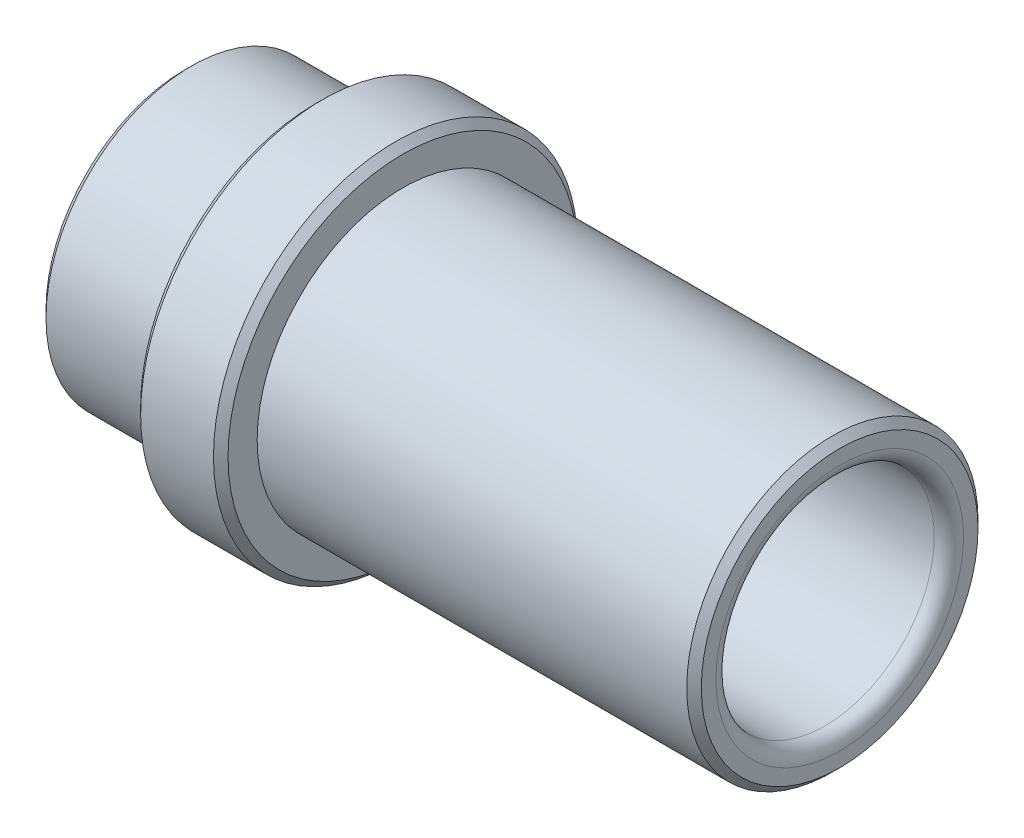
ISO-10303-21;
HEADER;
FILE_DESCRIPTION(('STEP AP214'),'2;1');
FILE_NAME('part.step','',(''),(''),'','','');
FILE_SCHEMA(('AUTOMOTIVE_DESIGN { 1 0 10303 214 1 1 1 1 }'));
ENDSEC;
DATA;
#1=APPLICATION_CONTEXT('core data for automotive mechanical design processes');
#2=APPLICATION_PROTOCOL_DEFINITION('international standard','automotive_design',2000,#1);
#3=PRODUCT_CONTEXT('',#1,'mechanical');
#4=PRODUCT('Part','Part','',(#3));
#5=PRODUCT_RELATED_PRODUCT_CATEGORY('part','',(#4));
#6=PRODUCT_DEFINITION_FORMATION('','',#4);
#7=PRODUCT_DEFINITION_CONTEXT('part definition',#1,'design');
#8=PRODUCT_DEFINITION('design','',#6,#7);
#9=PRODUCT_DEFINITION_SHAPE('','',#8);
#10=(LENGTH_UNIT() NAMED_UNIT(*) SI_UNIT(.MILLI.,.METRE.));
#11=(NAMED_UNIT(*) PLANE_ANGLE_UNIT() SI_UNIT($,.RADIAN.));
#12=(NAMED_UNIT(*) SI_UNIT($,.STERADIAN.) SOLID_ANGLE_UNIT());
#13=UNCERTAINTY_MEASURE_WITH_UNIT(LENGTH_MEASURE(1.E-05),#10,'distance_accuracy_value','');
#14=(GEOMETRIC_REPRESENTATION_CONTEXT(3) GLOBAL_UNCERTAINTY_ASSIGNED_CONTEXT((#13)) GLOBAL_UNIT_ASSIGNED_CONTEXT((#10,
#11,#12)) REPRESENTATION_CONTEXT('',''));
#15=CARTESIAN_POINT('',(0.,0.,0.));
#16=DIRECTION('',(0.,0.,1.));
#17=DIRECTION('',(1.,0.,0.));
#18=AXIS2_PLACEMENT_3D('',#15,#16,#17);
#19=CARTESIAN_POINT('',(-64.6395024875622,0.,0.));
#20=DIRECTION('',(-1.,0.,0.));
#21=DIRECTION('',(0.,0.,1.));
#22=AXIS2_PLACEMENT_3D('',#19,#20,#21);
#23=CYLINDRICAL_SURFACE('',#22,7.5);
#24=CARTESIAN_POINT('',(1.,0.,0.));
#25=DIRECTION('',(1.,0.,0.));
#26=DIRECTION('',(0.,0.,-1.));
#27=AXIS2_PLACEMENT_3D('',#24,#25,#26);
#28=CIRCLE('',#27,7.5);
#29=CARTESIAN_POINT('',(1.,0.,-7.5));
#30=VERTEX_POINT('',#29);
#31=EDGE_CURVE('E40',#30,#30,#28,.F.);
#32=ORIENTED_EDGE('',*,*,#31,.T.);
#33=EDGE_LOOP('',(#32));
#34=FACE_BOUND('',#33,.T.);
#35=CARTESIAN_POINT('',(44.,0.,0.));
#36=DIRECTION('',(-1.,0.,0.));
#37=DIRECTION('',(0.,0.,1.));
#38=AXIS2_PLACEMENT_3D('',#35,#36,#37);
#39=CIRCLE('',#38,7.5);
#40=CARTESIAN_POINT('',(44.,0.,7.5));
#41=VERTEX_POINT('',#40);
#42=EDGE_CURVE('E44',#41,#41,#39,.F.);
#43=ORIENTED_EDGE('',*,*,#42,.T.);
#44=EDGE_LOOP('',(#43));
#45=FACE_BOUND('',#44,.T.);
#46=ADVANCED_FACE('F30',(#34,#45),#23,.F.);
#47=CARTESIAN_POINT('',(0.,7.49999999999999,0.));
#48=DIRECTION('',(1.,0.,0.));
#49=DIRECTION('',(0.,0.,-1.));
#50=AXIS2_PLACEMENT_3D('',#47,#48,#49);
#51=PLANE('',#50);
#52=CARTESIAN_POINT('',(0.,0.,0.));
#53=DIRECTION('',(1.,0.,0.));
#54=DIRECTION('',(0.,0.,-1.));
#55=AXIS2_PLACEMENT_3D('',#52,#53,#54);
#56=CIRCLE('',#55,8.5);
#57=CARTESIAN_POINT('',(0.,0.,-8.5));
#58=VERTEX_POINT('',#57);
#59=EDGE_CURVE('E36',#58,#58,#56,.T.);
#60=ORIENTED_EDGE('',*,*,#59,.T.);
#61=EDGE_LOOP('',(#60));
#62=FACE_BOUND('',#61,.T.);
#63=CARTESIAN_POINT('',(0.,0.,0.));
#64=DIRECTION('',(1.,0.,0.));
#65=DIRECTION('',(0.,0.,-1.));
#66=AXIS2_PLACEMENT_3D('',#63,#64,#65);
#67=CIRCLE('',#66,9.49999999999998);
#68=CARTESIAN_POINT('',(0.,0.,-9.49999999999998));
#69=VERTEX_POINT('',#68);
#70=EDGE_CURVE('E52',#69,#69,#67,.F.);
#71=ORIENTED_EDGE('',*,*,#70,.T.);
#72=EDGE_LOOP('',(#71));
#73=FACE_BOUND('',#72,.T.);
#74=ADVANCED_FACE('F97',(#62,#73),#51,.F.);
#75=CARTESIAN_POINT('',(-64.6395024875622,0.,0.));
#76=DIRECTION('',(-1.,0.,0.));
#77=DIRECTION('',(0.,0.,1.));
#78=AXIS2_PLACEMENT_3D('',#75,#76,#77);
#79=CYLINDRICAL_SURFACE('',#78,10.);
#80=CARTESIAN_POINT('',(0.500000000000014,0.,0.));
#81=DIRECTION('',(1.,0.,0.));
#82=DIRECTION('',(0.,0.,-1.));
#83=AXIS2_PLACEMENT_3D('',#80,#81,#82);
#84=CIRCLE('',#83,10.);
#85=CARTESIAN_POINT('',(0.500000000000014,0.,-10.));
#86=VERTEX_POINT('',#85);
#87=EDGE_CURVE('E49',#86,#86,#84,.T.);
#88=ORIENTED_EDGE('',*,*,#87,.T.);
#89=EDGE_LOOP('',(#88));
#90=FACE_BOUND('',#89,.T.);
#91=CARTESIAN_POINT('',(8.99999999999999,0.,0.));
#92=DIRECTION('',(-1.,0.,0.));
#93=DIRECTION('',(0.,0.,1.));
#94=AXIS2_PLACEMENT_3D('',#91,#92,#93);
#95=CIRCLE('',#94,10.);
#96=CARTESIAN_POINT('',(8.99999999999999,0.,10.));
#97=VERTEX_POINT('',#96);
#98=EDGE_CURVE('E73',#97,#97,#95,.T.);
#99=ORIENTED_EDGE('',*,*,#98,.T.);
#100=EDGE_LOOP('',(#99));
#101=FACE_BOUND('',#100,.T.);
#102=ADVANCED_FACE('F102',(#90,#101),#79,.T.);
#103=CARTESIAN_POINT('',(9.,10.,0.));
#104=DIRECTION('',(1.,0.,0.));
#105=DIRECTION('',(0.,0.,-1.));
#106=AXIS2_PLACEMENT_3D('',#103,#104,#105);
#107=PLANE('',#106);
#108=CARTESIAN_POINT('',(9.,0.,0.));
#109=DIRECTION('',(1.,0.,0.));
#110=DIRECTION('',(0.,0.,-1.));
#111=AXIS2_PLACEMENT_3D('',#108,#109,#110);
#112=CIRCLE('',#111,12.);
#113=CARTESIAN_POINT('',(9.,0.,-12.));
#114=VERTEX_POINT('',#113);
#115=EDGE_CURVE('E55',#114,#114,#112,.F.);
#116=ORIENTED_EDGE('',*,*,#115,.T.);
#117=EDGE_LOOP('',(#116));
#118=FACE_BOUND('',#117,.T.);
#119=ORIENTED_EDGE('',*,*,#98,.F.);
#120=EDGE_LOOP('',(#119));
#121=FACE_BOUND('',#120,.T.);
#122=ADVANCED_FACE('F184',(#118,#121),#107,.F.);
#123=CARTESIAN_POINT('',(-64.6395024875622,0.,0.));
#124=DIRECTION('',(-1.,0.,0.));
#125=DIRECTION('',(0.,0.,1.));
#126=AXIS2_PLACEMENT_3D('',#123,#124,#125);
#127=CYLINDRICAL_SURFACE('',#126,12.5);
#128=CARTESIAN_POINT('',(14.5,0.,0.));
#129=DIRECTION('',(-1.,0.,0.));
#130=DIRECTION('',(0.,0.,1.));
#131=AXIS2_PLACEMENT_3D('',#128,#129,#130);
#132=CIRCLE('',#131,12.5);
#133=CARTESIAN_POINT('',(14.5,0.,12.5));
#134=VERTEX_POINT('',#133);
#135=EDGE_CURVE('E61',#134,#134,#132,.T.);
#136=ORIENTED_EDGE('',*,*,#135,.T.);
#137=EDGE_LOOP('',(#136));
#138=FACE_BOUND('',#137,.T.);
#139=CARTESIAN_POINT('',(9.49999999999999,0.,0.));
#140=DIRECTION('',(1.,0.,0.));
#141=DIRECTION('',(0.,0.,-1.));
#142=AXIS2_PLACEMENT_3D('',#139,#140,#141);
#143=CIRCLE('',#142,12.5);
#144=CARTESIAN_POINT('',(9.49999999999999,0.,-12.5));
#145=VERTEX_POINT('',#144);
#146=EDGE_CURVE('E64',#145,#145,#143,.T.);
#147=ORIENTED_EDGE('',*,*,#146,.T.);
#148=EDGE_LOOP('',(#147));
#149=FACE_BOUND('',#148,.T.);
#150=ADVANCED_FACE('F93',(#138,#149),#127,.T.);
#151=CARTESIAN_POINT('',(15.,12.5,0.));
#152=DIRECTION('',(-1.,0.,0.));
#153=DIRECTION('',(0.,0.,1.));
#154=AXIS2_PLACEMENT_3D('',#151,#152,#153);
#155=PLANE('',#154);
#156=CARTESIAN_POINT('',(15.,0.,0.));
#157=DIRECTION('',(-1.,0.,0.));
#158=DIRECTION('',(0.,0.,1.));
#159=AXIS2_PLACEMENT_3D('',#156,#157,#158);
#160=CIRCLE('',#159,12.);
#161=CARTESIAN_POINT('',(15.,0.,12.));
#162=VERTEX_POINT('',#161);
#163=EDGE_CURVE('E58',#162,#162,#160,.F.);
#164=ORIENTED_EDGE('',*,*,#163,.T.);
#165=EDGE_LOOP('',(#164));
#166=FACE_BOUND('',#165,.T.);
#167=CARTESIAN_POINT('',(15.,0.,0.));
#168=DIRECTION('',(-1.,0.,0.));
#169=DIRECTION('',(0.,0.,1.));
#170=AXIS2_PLACEMENT_3D('',#167,#168,#169);
#171=CIRCLE('',#170,10.);
#172=CARTESIAN_POINT('',(15.,0.,10.));
#173=VERTEX_POINT('',#172);
#174=EDGE_CURVE('E76',#173,#173,#171,.T.);
#175=ORIENTED_EDGE('',*,*,#174,.T.);
#176=EDGE_LOOP('',(#175));
#177=FACE_BOUND('',#176,.T.);
#178=ADVANCED_FACE('F80',(#166,#177),#155,.F.);
#179=CARTESIAN_POINT('',(-64.6395024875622,0.,0.));
#180=DIRECTION('',(-1.,0.,0.));
#181=DIRECTION('',(0.,0.,1.));
#182=AXIS2_PLACEMENT_3D('',#179,#180,#181);
#183=CYLINDRICAL_SURFACE('',#182,10.);
#184=CARTESIAN_POINT('',(44.5,0.,0.));
#185=DIRECTION('',(-1.,0.,0.));
#186=DIRECTION('',(0.,0.,1.));
#187=AXIS2_PLACEMENT_3D('',#184,#185,#186);
#188=CIRCLE('',#187,10.);
#189=CARTESIAN_POINT('',(44.5,0.,10.));
#190=VERTEX_POINT('',#189);
#191=EDGE_CURVE('E70',#190,#190,#188,.T.);
#192=ORIENTED_EDGE('',*,*,#191,.T.);
#193=EDGE_LOOP('',(#192));
#194=FACE_BOUND('',#193,.T.);
#195=ORIENTED_EDGE('',*,*,#174,.F.);
#196=EDGE_LOOP('',(#195));
#197=FACE_BOUND('',#196,.T.);
#198=ADVANCED_FACE('F82',(#194,#197),#183,.T.);
#199=CARTESIAN_POINT('',(45.,10.,0.));
#200=DIRECTION('',(-1.,0.,0.));
#201=DIRECTION('',(0.,0.,1.));
#202=AXIS2_PLACEMENT_3D('',#199,#200,#201);
#203=PLANE('',#202);
#204=CARTESIAN_POINT('',(45.,0.,0.));
#205=DIRECTION('',(-1.,0.,0.));
#206=DIRECTION('',(0.,0.,1.));
#207=AXIS2_PLACEMENT_3D('',#204,#205,#206);
#208=CIRCLE('',#207,8.5);
#209=CARTESIAN_POINT('',(45.,0.,8.5));
#210=VERTEX_POINT('',#209);
#211=EDGE_CURVE('E10',#210,#210,#208,.T.);
#212=ORIENTED_EDGE('',*,*,#211,.T.);
#213=EDGE_LOOP('',(#212));
#214=FACE_BOUND('',#213,.T.);
#215=CARTESIAN_POINT('',(45.,0.,0.));
#216=DIRECTION('',(-1.,0.,0.));
#217=DIRECTION('',(0.,0.,1.));
#218=AXIS2_PLACEMENT_3D('',#215,#216,#217);
#219=CIRCLE('',#218,9.49999999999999);
#220=CARTESIAN_POINT('',(45.,0.,9.49999999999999));
#221=VERTEX_POINT('',#220);
#222=EDGE_CURVE('E67',#221,#221,#219,.F.);
#223=ORIENTED_EDGE('',*,*,#222,.T.);
#224=EDGE_LOOP('',(#223));
#225=FACE_BOUND('',#224,.T.);
#226=ADVANCED_FACE('F84',(#214,#225),#203,.F.);
#227=CARTESIAN_POINT('',(44.5,0.,0.));
#228=DIRECTION('',(-1.,0.,0.));
#229=DIRECTION('',(0.,0.,1.));
#230=AXIS2_PLACEMENT_3D('',#227,#228,#229);
#231=CONICAL_SURFACE('',#230,10.,0.78539816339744);
#232=ORIENTED_EDGE('',*,*,#222,.F.);
#233=EDGE_LOOP('',(#232));
#234=FACE_BOUND('',#233,.T.);
#235=ORIENTED_EDGE('',*,*,#191,.F.);
#236=EDGE_LOOP('',(#235));
#237=FACE_BOUND('',#236,.T.);
#238=ADVANCED_FACE('F91',(#234,#237),#231,.T.);
#239=CARTESIAN_POINT('',(14.5,0.,0.));
#240=DIRECTION('',(-1.,0.,0.));
#241=DIRECTION('',(0.,0.,1.));
#242=AXIS2_PLACEMENT_3D('',#239,#240,#241);
#243=CONICAL_SURFACE('',#242,12.5,0.785398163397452);
#244=ORIENTED_EDGE('',*,*,#163,.F.);
#245=EDGE_LOOP('',(#244));
#246=FACE_BOUND('',#245,.T.);
#247=ORIENTED_EDGE('',*,*,#135,.F.);
#248=EDGE_LOOP('',(#247));
#249=FACE_BOUND('',#248,.T.);
#250=ADVANCED_FACE('F125',(#246,#249),#243,.T.);
#251=CARTESIAN_POINT('',(8.99999999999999,0.,0.));
#252=DIRECTION('',(1.,0.,0.));
#253=DIRECTION('',(0.,0.,-1.));
#254=AXIS2_PLACEMENT_3D('',#251,#252,#253);
#255=CONICAL_SURFACE('',#254,12.,0.785398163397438);
#256=ORIENTED_EDGE('',*,*,#146,.F.);
#257=EDGE_LOOP('',(#256));
#258=FACE_BOUND('',#257,.T.);
#259=ORIENTED_EDGE('',*,*,#115,.F.);
#260=EDGE_LOOP('',(#259));
#261=FACE_BOUND('',#260,.T.);
#262=ADVANCED_FACE('F121',(#258,#261),#255,.T.);
#263=CARTESIAN_POINT('',(0.,0.,0.));
#264=DIRECTION('',(1.,0.,0.));
#265=DIRECTION('',(0.,0.,-1.));
#266=AXIS2_PLACEMENT_3D('',#263,#264,#265);
#267=CONICAL_SURFACE('',#266,9.49999999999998,0.785398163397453);
#268=ORIENTED_EDGE('',*,*,#87,.F.);
#269=EDGE_LOOP('',(#268));
#270=FACE_BOUND('',#269,.T.);
#271=ORIENTED_EDGE('',*,*,#70,.F.);
#272=EDGE_LOOP('',(#271));
#273=FACE_BOUND('',#272,.T.);
#274=ADVANCED_FACE('F115',(#270,#273),#267,.T.);
#275=CARTESIAN_POINT('',(1.,0.,0.));
#276=DIRECTION('',(1.,0.,0.));
#277=DIRECTION('',(0.,0.,-1.));
#278=AXIS2_PLACEMENT_3D('',#275,#276,#277);
#279=TOROIDAL_SURFACE('',#278,8.5,1.);
#280=ORIENTED_EDGE('',*,*,#59,.F.);
#281=EDGE_LOOP('',(#280));
#282=FACE_BOUND('',#281,.T.);
#283=ORIENTED_EDGE('',*,*,#31,.F.);
#284=EDGE_LOOP('',(#283));
#285=FACE_BOUND('',#284,.T.);
#286=ADVANCED_FACE('F110',(#282,#285),#279,.T.);
#287=CARTESIAN_POINT('',(44.,0.,0.));
#288=DIRECTION('',(-1.,0.,0.));
#289=DIRECTION('',(0.,0.,1.));
#290=AXIS2_PLACEMENT_3D('',#287,#288,#289);
#291=TOROIDAL_SURFACE('',#290,8.5,1.);
#292=ORIENTED_EDGE('',*,*,#42,.F.);
#293=EDGE_LOOP('',(#292));
#294=FACE_BOUND('',#293,.T.);
#295=ORIENTED_EDGE('',*,*,#211,.F.);
#296=EDGE_LOOP('',(#295));
#297=FACE_BOUND('',#296,.T.);
#298=ADVANCED_FACE('F107',(#294,#297),#291,.T.);
#299=CLOSED_SHELL('',(#46,#74,#102,#122,#150,#178,#198,#226,#238,#250,#262,#274,#286,#298));
#300=MANIFOLD_SOLID_BREP('B2',#299);
#301=ADVANCED_BREP_SHAPE_REPRESENTATION('',(#18,#300),#14);
#302=SHAPE_DEFINITION_REPRESENTATION(#9,#301);
ENDSEC;
END-ISO-10303-21;
